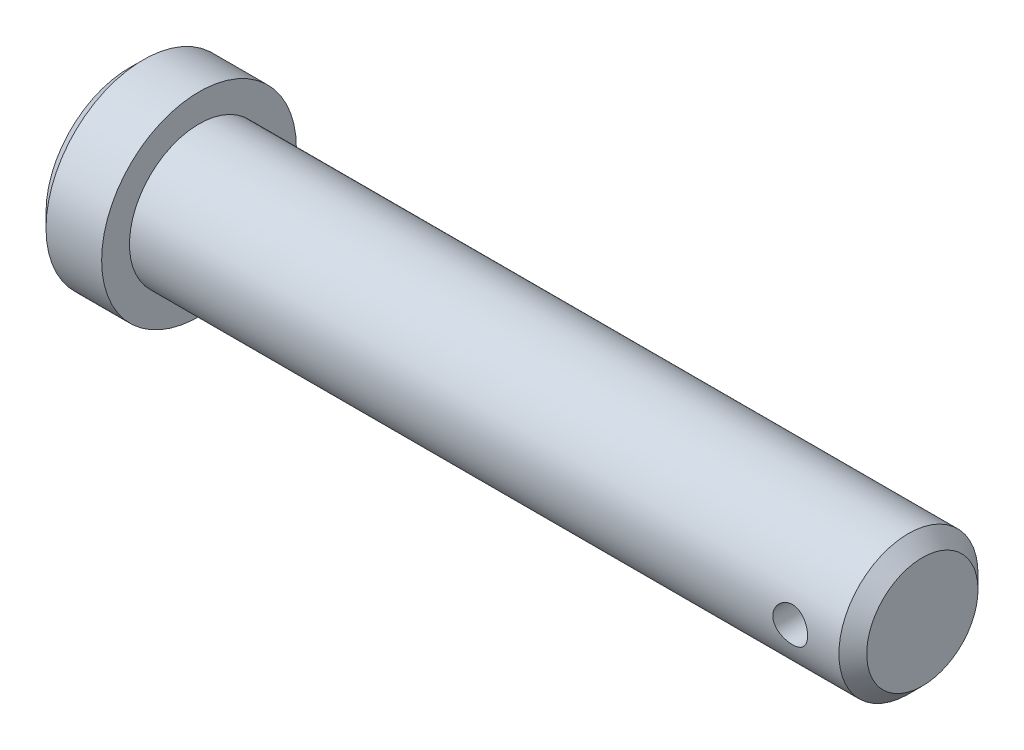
from build123d import *

# Parameters (mm, degrees)
CUT_EXTRUDE_1_DEPTH      = 58.853262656
CUT_EXTRUDE_1_DEPTH_BACK = 58.853262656
SKETCH_2_R               = 1.25
CHAMFER_1_SIZE           = 1
CHAMFER_2_SIZE           = 1


with BuildPart() as part:
    # Sketch 1 → Revolve 1 (revolve)
    with BuildSketch(Plane.XY, mode=Mode.PRIVATE) as revolve_1_sk:
        Polygon((0, 0), (0, 7), (5, 7), (5, 5), (57, 5), (57, 0), align=None)
    revolve(revolve_1_sk.sketch.rotate(Axis((57, 0, 0), (-1, 0, 0)), 90), axis=Axis((57, 0, 0), (-1, 0, 0)))

    # Sketch 2 → Cut-Extrude 1 (cut, two sides: drawn at the far end of the back side and taken through both)
    with BuildSketch(Plane.XY.offset(-CUT_EXTRUDE_1_DEPTH_BACK)):
        with Locations((52.5, 0)):
            Circle(SKETCH_2_R)
    extrude(amount=CUT_EXTRUDE_1_DEPTH + CUT_EXTRUDE_1_DEPTH_BACK, mode=Mode.SUBTRACT)

    # Chamfer 1
    chamfer_1_edges = [part.edges().sort_by_distance(p)[0] for p in [
        (0, 0, 7),
    ]]
    chamfer(chamfer_1_edges, length=CHAMFER_1_SIZE)

    # Chamfer 2
    chamfer_2_edges = [part.edges().sort_by_distance(p)[0] for p in [
        (57, 0, 5),
    ]]
    chamfer(chamfer_2_edges, length=CHAMFER_2_SIZE)


solid = part.part
